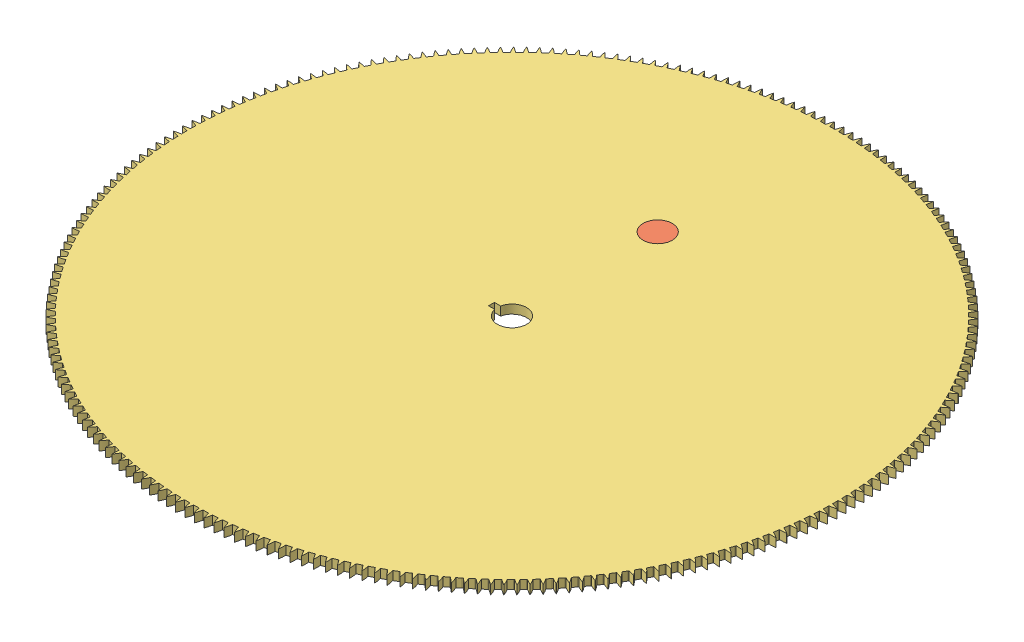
SolidWorks assembly Gear E3-E4.SLDASM, configuration Default (file format 6000). Lengths in mm.
Overall size (112.49 4.5 112.5).
3 component instances, 3 part files, 9 mates.
Components (placement in the parent):
- Gear 188T-1: Gear 188T.sldprt [Default] at (0.4993 -1.5 -2.4496) x (0.031206 0 0.999513) z (0.999513 0 -0.031206) size (95 1.5 95)
- Axle K-1: Axle K.SLDPRT [Default] at (0.4993 -3 -27.3176) x (0 0 1) z (-1 0 0) size (5 4.5 5)
- Gear 223T Axle E Gear 3-1: Gear 223T Axle E Gear 3.SLDPRT [Default] at (0.4993 -1.5 -2.4496) x (0 0 -1) z (1 0 0) size (112.5 1.5 112.49)
Mates (geometry in assembly coordinates):
- Coincident1: coincident anti-aligned: plane of Gear 188T-1 through (16.2679 -1.5 -68.9074) normal (0 1 0); plane of Gear 223T Axle E Gear 3-1 through (21.6544 -1.5 75.7585) normal (0 -1 0)
- Concentric1: concentric aligned: circle of Gear 188T-1; circle of Gear 223T Axle E Gear 3-1
- Coincident2: coincident aligned: plane of Axle K-1 through (0.4993 0 -27.3176) normal (0 1 0); plane of Gear 223T Axle E Gear 3-1 through (21.6544 0 75.7585) normal (0 1 0)
- Concentric2: concentric anti-aligned: cylinder of Axle K-1 through (0.4993 0 -27.3176) axis (0 -1 0) radius 2.5; cylinder of Gear 223T Axle E Gear 3-1 through (0.4993 -8.5711 -27.3176) axis (0 1 0) radius 2.5
- Parallel2: parallel aligned: plane of Gear 188T-1 through (-32.3652 -3 30.2699) normal (-0.714538 0 0.699596); plane of Gear 223T Axle E Gear 3-1 through (-39.1603 0 35.8372) normal (-0.714538 0 0.699596)
- Coincident4: coincident aligned: plane of Gear 223T Axle E Gear 3-1 through (21.6544 0 75.7585) normal (0 1 0); plane of assembly
- Coincident9: coincident: circle of Gear 223T Axle E Gear 3-1; point of assembly
- Parallel3: parallel aligned: plane of Gear 223T Axle E Gear 3-1 through (-3.0007 -3.7361 -2.9496) normal (1 0 0); plane of assembly through (0 0 0) normal (1 0 0)
- Parallel4: parallel: line of Axle K-1 through (0.4993 -3 -24.8176) axis (0 0 -1); plane of assembly
